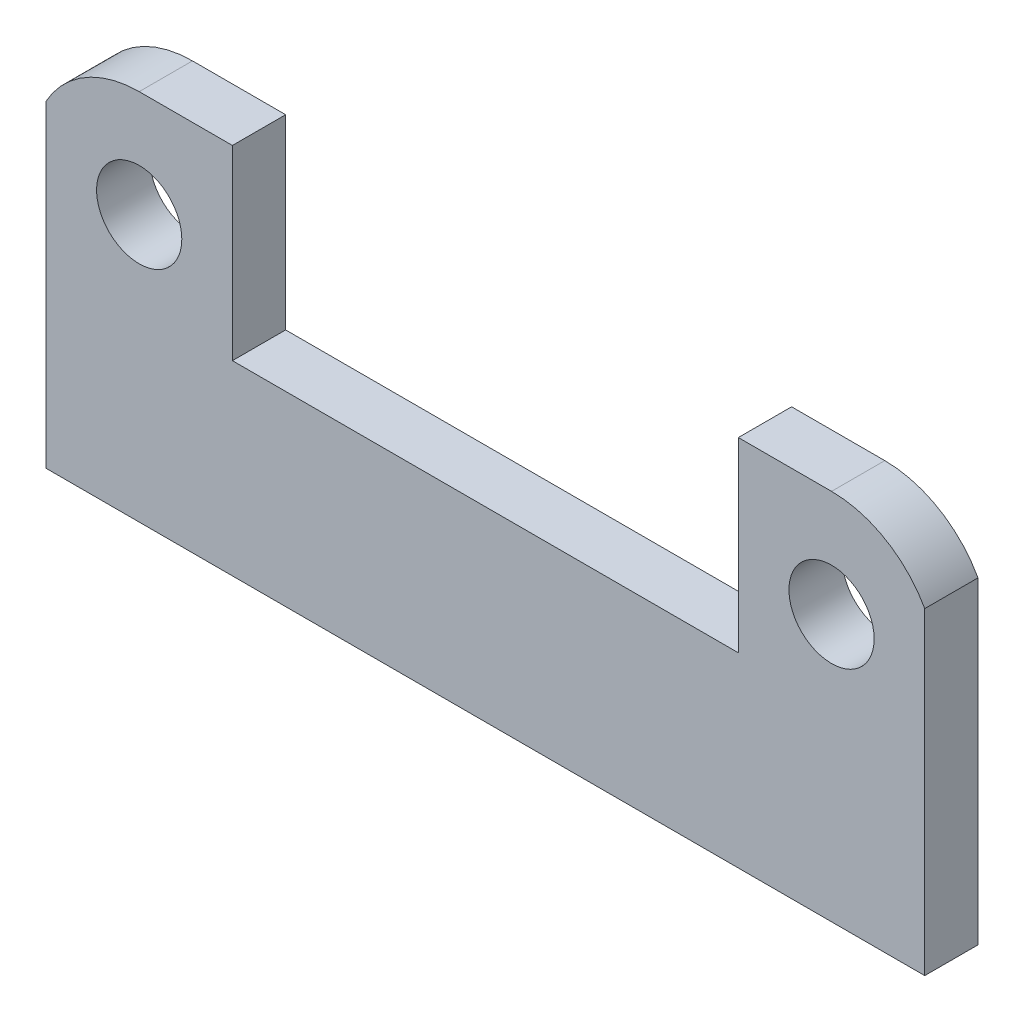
ISO-10303-21;
HEADER;
FILE_DESCRIPTION(('STEP AP214'),'2;1');
FILE_NAME('part.step','',(''),(''),'','','');
FILE_SCHEMA(('AUTOMOTIVE_DESIGN { 1 0 10303 214 1 1 1 1 }'));
ENDSEC;
DATA;
#1=APPLICATION_CONTEXT('core data for automotive mechanical design processes');
#2=APPLICATION_PROTOCOL_DEFINITION('international standard','automotive_design',2000,#1);
#3=PRODUCT_CONTEXT('',#1,'mechanical');
#4=PRODUCT('Part','Part','',(#3));
#5=PRODUCT_RELATED_PRODUCT_CATEGORY('part','',(#4));
#6=PRODUCT_DEFINITION_FORMATION('','',#4);
#7=PRODUCT_DEFINITION_CONTEXT('part definition',#1,'design');
#8=PRODUCT_DEFINITION('design','',#6,#7);
#9=PRODUCT_DEFINITION_SHAPE('','',#8);
#10=(LENGTH_UNIT() NAMED_UNIT(*) SI_UNIT(.MILLI.,.METRE.));
#11=(NAMED_UNIT(*) PLANE_ANGLE_UNIT() SI_UNIT($,.RADIAN.));
#12=(NAMED_UNIT(*) SI_UNIT($,.STERADIAN.) SOLID_ANGLE_UNIT());
#13=UNCERTAINTY_MEASURE_WITH_UNIT(LENGTH_MEASURE(1.E-05),#10,'distance_accuracy_value','');
#14=(GEOMETRIC_REPRESENTATION_CONTEXT(3) GLOBAL_UNCERTAINTY_ASSIGNED_CONTEXT((#13)) GLOBAL_UNIT_ASSIGNED_CONTEXT((#10,
#11,#12)) REPRESENTATION_CONTEXT('',''));
#15=CARTESIAN_POINT('',(0.,0.,0.));
#16=DIRECTION('',(0.,0.,1.));
#17=DIRECTION('',(1.,0.,0.));
#18=AXIS2_PLACEMENT_3D('',#15,#16,#17);
#19=CARTESIAN_POINT('',(2.68385255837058,0.,2.));
#20=DIRECTION('',(-1.,0.,0.));
#21=DIRECTION('',(0.,0.,1.));
#22=AXIS2_PLACEMENT_3D('',#19,#20,#21);
#23=PLANE('',#22);
#24=DIRECTION('',(0.,1.,0.));
#25=VECTOR('',#24,1.);
#26=CARTESIAN_POINT('',(2.68385255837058,0.,0.));
#27=LINE('',#26,#25);
#28=CARTESIAN_POINT('',(2.68385255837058,15.7411385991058,0.));
#29=VERTEX_POINT('',#28);
#30=CARTESIAN_POINT('',(2.68385255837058,22.7411385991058,0.));
#31=VERTEX_POINT('',#30);
#32=EDGE_CURVE('E153',#29,#31,#27,.T.);
#33=ORIENTED_EDGE('',*,*,#32,.T.);
#34=DIRECTION('',(0.,0.,-1.));
#35=VECTOR('',#34,1.);
#36=CARTESIAN_POINT('',(2.68385255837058,22.7411385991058,2.));
#37=LINE('',#36,#35);
#38=CARTESIAN_POINT('',(2.68385255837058,22.7411385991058,2.));
#39=VERTEX_POINT('',#38);
#40=EDGE_CURVE('E11',#39,#31,#37,.T.);
#41=ORIENTED_EDGE('',*,*,#40,.F.);
#42=DIRECTION('',(0.,1.,0.));
#43=VECTOR('',#42,1.);
#44=CARTESIAN_POINT('',(2.68385255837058,0.,2.));
#45=LINE('',#44,#43);
#46=CARTESIAN_POINT('',(2.68385255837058,15.7411385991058,2.));
#47=VERTEX_POINT('',#46);
#48=EDGE_CURVE('E97',#47,#39,#45,.T.);
#49=ORIENTED_EDGE('',*,*,#48,.F.);
#50=DIRECTION('',(0.,0.,-1.));
#51=VECTOR('',#50,1.);
#52=CARTESIAN_POINT('',(2.68385255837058,15.7411385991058,2.));
#53=LINE('',#52,#51);
#54=EDGE_CURVE('E54',#47,#29,#53,.T.);
#55=ORIENTED_EDGE('',*,*,#54,.T.);
#56=EDGE_LOOP('',(#33,#41,#49,#55));
#57=FACE_BOUND('',#56,.T.);
#58=ADVANCED_FACE('F37',(#57),#23,.F.);
#59=CARTESIAN_POINT('',(0.,22.7411385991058,2.));
#60=DIRECTION('',(0.,1.,0.));
#61=DIRECTION('',(-1.,0.,0.));
#62=AXIS2_PLACEMENT_3D('',#59,#60,#61);
#63=PLANE('',#62);
#64=DIRECTION('',(1.,0.,0.));
#65=VECTOR('',#64,1.);
#66=CARTESIAN_POINT('',(0.,22.7411385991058,0.));
#67=LINE('',#66,#65);
#68=CARTESIAN_POINT('',(-0.816147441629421,22.7411385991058,0.));
#69=VERTEX_POINT('',#68);
#70=EDGE_CURVE('E155',#69,#31,#67,.T.);
#71=ORIENTED_EDGE('',*,*,#70,.F.);
#72=DIRECTION('',(0.,0.,-1.));
#73=VECTOR('',#72,1.);
#74=CARTESIAN_POINT('',(-0.816147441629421,22.7411385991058,2.));
#75=LINE('',#74,#73);
#76=CARTESIAN_POINT('',(-0.816147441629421,22.7411385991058,2.));
#77=VERTEX_POINT('',#76);
#78=EDGE_CURVE('E46',#77,#69,#75,.T.);
#79=ORIENTED_EDGE('',*,*,#78,.F.);
#80=DIRECTION('',(1.,0.,0.));
#81=VECTOR('',#80,1.);
#82=CARTESIAN_POINT('',(0.,22.7411385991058,2.));
#83=LINE('',#82,#81);
#84=EDGE_CURVE('E207',#77,#39,#83,.T.);
#85=ORIENTED_EDGE('',*,*,#84,.T.);
#86=ORIENTED_EDGE('',*,*,#40,.T.);
#87=EDGE_LOOP('',(#71,#79,#85,#86));
#88=FACE_BOUND('',#87,.T.);
#89=ADVANCED_FACE('F206',(#88),#63,.T.);
#90=CARTESIAN_POINT('',(-0.816147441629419,18.7411385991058,2.));
#91=DIRECTION('',(0.,0.,-1.));
#92=DIRECTION('',(-1.,0.,0.));
#93=AXIS2_PLACEMENT_3D('',#90,#91,#92);
#94=CYLINDRICAL_SURFACE('',#93,4.);
#95=CARTESIAN_POINT('',(-0.816147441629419,18.7411385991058,0.));
#96=DIRECTION('',(0.,0.,1.));
#97=DIRECTION('',(1.,0.,0.));
#98=AXIS2_PLACEMENT_3D('',#95,#96,#97);
#99=CIRCLE('',#98,4.);
#100=CARTESIAN_POINT('',(-4.31614744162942,20.6776302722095,0.));
#101=VERTEX_POINT('',#100);
#102=EDGE_CURVE('E158',#69,#101,#99,.T.);
#103=ORIENTED_EDGE('',*,*,#102,.T.);
#104=DIRECTION('',(0.,0.,-1.));
#105=VECTOR('',#104,1.);
#106=CARTESIAN_POINT('',(-4.31614744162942,20.6776302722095,2.));
#107=LINE('',#106,#105);
#108=CARTESIAN_POINT('',(-4.31614744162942,20.6776302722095,2.));
#109=VERTEX_POINT('',#108);
#110=EDGE_CURVE('E191',#109,#101,#107,.T.);
#111=ORIENTED_EDGE('',*,*,#110,.F.);
#112=CARTESIAN_POINT('',(-0.816147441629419,18.7411385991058,2.));
#113=DIRECTION('',(0.,0.,1.));
#114=DIRECTION('',(1.,0.,0.));
#115=AXIS2_PLACEMENT_3D('',#112,#113,#114);
#116=CIRCLE('',#115,4.);
#117=EDGE_CURVE('E197',#77,#109,#116,.T.);
#118=ORIENTED_EDGE('',*,*,#117,.F.);
#119=ORIENTED_EDGE('',*,*,#78,.T.);
#120=EDGE_LOOP('',(#103,#111,#118,#119));
#121=FACE_BOUND('',#120,.T.);
#122=ADVANCED_FACE('F195',(#121),#94,.T.);
#123=CARTESIAN_POINT('',(-4.31614744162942,0.,2.));
#124=DIRECTION('',(-1.,0.,0.));
#125=DIRECTION('',(0.,0.,1.));
#126=AXIS2_PLACEMENT_3D('',#123,#124,#125);
#127=PLANE('',#126);
#128=DIRECTION('',(0.,1.,0.));
#129=VECTOR('',#128,1.);
#130=CARTESIAN_POINT('',(-4.31614744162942,0.,0.));
#131=LINE('',#130,#129);
#132=CARTESIAN_POINT('',(-4.31614744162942,8.74113859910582,0.));
#133=VERTEX_POINT('',#132);
#134=EDGE_CURVE('E161',#133,#101,#131,.T.);
#135=ORIENTED_EDGE('',*,*,#134,.F.);
#136=DIRECTION('',(0.,0.,-1.));
#137=VECTOR('',#136,1.);
#138=CARTESIAN_POINT('',(-4.31614744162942,8.74113859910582,2.));
#139=LINE('',#138,#137);
#140=CARTESIAN_POINT('',(-4.31614744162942,8.74113859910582,2.));
#141=VERTEX_POINT('',#140);
#142=EDGE_CURVE('E189',#141,#133,#139,.T.);
#143=ORIENTED_EDGE('',*,*,#142,.F.);
#144=DIRECTION('',(0.,1.,0.));
#145=VECTOR('',#144,1.);
#146=CARTESIAN_POINT('',(-4.31614744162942,0.,2.));
#147=LINE('',#146,#145);
#148=EDGE_CURVE('E351',#141,#109,#147,.T.);
#149=ORIENTED_EDGE('',*,*,#148,.T.);
#150=ORIENTED_EDGE('',*,*,#110,.T.);
#151=EDGE_LOOP('',(#135,#143,#149,#150));
#152=FACE_BOUND('',#151,.T.);
#153=ADVANCED_FACE('F227',(#152),#127,.T.);
#154=CARTESIAN_POINT('',(0.,8.74113859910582,2.));
#155=DIRECTION('',(0.,1.,0.));
#156=DIRECTION('',(0.,0.,1.));
#157=AXIS2_PLACEMENT_3D('',#154,#155,#156);
#158=PLANE('',#157);
#159=DIRECTION('',(1.,0.,0.));
#160=VECTOR('',#159,1.);
#161=CARTESIAN_POINT('',(0.,8.74113859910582,0.));
#162=LINE('',#161,#160);
#163=CARTESIAN_POINT('',(28.6838525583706,8.74113859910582,0.));
#164=VERTEX_POINT('',#163);
#165=EDGE_CURVE('E164',#133,#164,#162,.T.);
#166=ORIENTED_EDGE('',*,*,#165,.T.);
#167=DIRECTION('',(0.,0.,-1.));
#168=VECTOR('',#167,1.);
#169=CARTESIAN_POINT('',(28.6838525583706,8.74113859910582,2.));
#170=LINE('',#169,#168);
#171=CARTESIAN_POINT('',(28.6838525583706,8.74113859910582,2.));
#172=VERTEX_POINT('',#171);
#173=EDGE_CURVE('E187',#172,#164,#170,.T.);
#174=ORIENTED_EDGE('',*,*,#173,.F.);
#175=DIRECTION('',(1.,0.,0.));
#176=VECTOR('',#175,1.);
#177=CARTESIAN_POINT('',(0.,8.74113859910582,2.));
#178=LINE('',#177,#176);
#179=EDGE_CURVE('E354',#141,#172,#178,.T.);
#180=ORIENTED_EDGE('',*,*,#179,.F.);
#181=ORIENTED_EDGE('',*,*,#142,.T.);
#182=EDGE_LOOP('',(#166,#174,#180,#181));
#183=FACE_BOUND('',#182,.T.);
#184=ADVANCED_FACE('F230',(#183),#158,.F.);
#185=CARTESIAN_POINT('',(28.6838525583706,0.,2.));
#186=DIRECTION('',(1.,0.,0.));
#187=DIRECTION('',(0.,0.,-1.));
#188=AXIS2_PLACEMENT_3D('',#185,#186,#187);
#189=PLANE('',#188);
#190=DIRECTION('',(0.,-1.,0.));
#191=VECTOR('',#190,1.);
#192=CARTESIAN_POINT('',(28.6838525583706,0.,0.));
#193=LINE('',#192,#191);
#194=CARTESIAN_POINT('',(28.6838525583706,20.6776302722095,0.));
#195=VERTEX_POINT('',#194);
#196=EDGE_CURVE('E167',#195,#164,#193,.T.);
#197=ORIENTED_EDGE('',*,*,#196,.F.);
#198=DIRECTION('',(0.,0.,-1.));
#199=VECTOR('',#198,1.);
#200=CARTESIAN_POINT('',(28.6838525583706,20.6776302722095,2.));
#201=LINE('',#200,#199);
#202=CARTESIAN_POINT('',(28.6838525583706,20.6776302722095,2.));
#203=VERTEX_POINT('',#202);
#204=EDGE_CURVE('E185',#203,#195,#201,.T.);
#205=ORIENTED_EDGE('',*,*,#204,.F.);
#206=DIRECTION('',(0.,-1.,0.));
#207=VECTOR('',#206,1.);
#208=CARTESIAN_POINT('',(28.6838525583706,0.,2.));
#209=LINE('',#208,#207);
#210=EDGE_CURVE('E356',#203,#172,#209,.T.);
#211=ORIENTED_EDGE('',*,*,#210,.T.);
#212=ORIENTED_EDGE('',*,*,#173,.T.);
#213=EDGE_LOOP('',(#197,#205,#211,#212));
#214=FACE_BOUND('',#213,.T.);
#215=ADVANCED_FACE('F234',(#214),#189,.T.);
#216=CARTESIAN_POINT('',(25.1838525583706,18.7411385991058,2.));
#217=DIRECTION('',(0.,0.,-1.));
#218=DIRECTION('',(-1.,0.,0.));
#219=AXIS2_PLACEMENT_3D('',#216,#217,#218);
#220=CYLINDRICAL_SURFACE('',#219,4.);
#221=CARTESIAN_POINT('',(25.1838525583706,18.7411385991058,0.));
#222=DIRECTION('',(0.,0.,1.));
#223=DIRECTION('',(1.,0.,0.));
#224=AXIS2_PLACEMENT_3D('',#221,#222,#223);
#225=CIRCLE('',#224,4.);
#226=CARTESIAN_POINT('',(25.1838525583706,22.7411385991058,0.));
#227=VERTEX_POINT('',#226);
#228=EDGE_CURVE('E170',#195,#227,#225,.T.);
#229=ORIENTED_EDGE('',*,*,#228,.T.);
#230=DIRECTION('',(0.,0.,-1.));
#231=VECTOR('',#230,1.);
#232=CARTESIAN_POINT('',(25.1838525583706,22.7411385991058,2.));
#233=LINE('',#232,#231);
#234=CARTESIAN_POINT('',(25.1838525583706,22.7411385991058,2.));
#235=VERTEX_POINT('',#234);
#236=EDGE_CURVE('E139',#235,#227,#233,.T.);
#237=ORIENTED_EDGE('',*,*,#236,.F.);
#238=CARTESIAN_POINT('',(25.1838525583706,18.7411385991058,2.));
#239=DIRECTION('',(0.,0.,1.));
#240=DIRECTION('',(1.,0.,0.));
#241=AXIS2_PLACEMENT_3D('',#238,#239,#240);
#242=CIRCLE('',#241,4.);
#243=EDGE_CURVE('E127',#203,#235,#242,.T.);
#244=ORIENTED_EDGE('',*,*,#243,.F.);
#245=ORIENTED_EDGE('',*,*,#204,.T.);
#246=EDGE_LOOP('',(#229,#237,#244,#245));
#247=FACE_BOUND('',#246,.T.);
#248=ADVANCED_FACE('F238',(#247),#220,.T.);
#249=CARTESIAN_POINT('',(0.,22.7411385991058,2.));
#250=DIRECTION('',(0.,-1.,0.));
#251=DIRECTION('',(1.,0.,0.));
#252=AXIS2_PLACEMENT_3D('',#249,#250,#251);
#253=PLANE('',#252);
#254=DIRECTION('',(-1.,0.,0.));
#255=VECTOR('',#254,1.);
#256=CARTESIAN_POINT('',(0.,22.7411385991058,0.));
#257=LINE('',#256,#255);
#258=CARTESIAN_POINT('',(21.6838525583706,22.7411385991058,0.));
#259=VERTEX_POINT('',#258);
#260=EDGE_CURVE('E136',#227,#259,#257,.T.);
#261=ORIENTED_EDGE('',*,*,#260,.T.);
#262=DIRECTION('',(0.,0.,-1.));
#263=VECTOR('',#262,1.);
#264=CARTESIAN_POINT('',(21.6838525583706,22.7411385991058,2.));
#265=LINE('',#264,#263);
#266=CARTESIAN_POINT('',(21.6838525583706,22.7411385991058,2.));
#267=VERTEX_POINT('',#266);
#268=EDGE_CURVE('E133',#267,#259,#265,.T.);
#269=ORIENTED_EDGE('',*,*,#268,.F.);
#270=DIRECTION('',(-1.,0.,0.));
#271=VECTOR('',#270,1.);
#272=CARTESIAN_POINT('',(0.,22.7411385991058,2.));
#273=LINE('',#272,#271);
#274=EDGE_CURVE('E119',#235,#267,#273,.T.);
#275=ORIENTED_EDGE('',*,*,#274,.F.);
#276=ORIENTED_EDGE('',*,*,#236,.T.);
#277=EDGE_LOOP('',(#261,#269,#275,#276));
#278=FACE_BOUND('',#277,.T.);
#279=ADVANCED_FACE('F134',(#278),#253,.F.);
#280=CARTESIAN_POINT('',(21.6838525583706,0.,2.));
#281=DIRECTION('',(-1.,0.,0.));
#282=DIRECTION('',(0.,0.,1.));
#283=AXIS2_PLACEMENT_3D('',#280,#281,#282);
#284=PLANE('',#283);
#285=DIRECTION('',(0.,1.,0.));
#286=VECTOR('',#285,1.);
#287=CARTESIAN_POINT('',(21.6838525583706,0.,0.));
#288=LINE('',#287,#286);
#289=CARTESIAN_POINT('',(21.6838525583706,15.7411385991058,0.));
#290=VERTEX_POINT('',#289);
#291=EDGE_CURVE('E173',#290,#259,#288,.T.);
#292=ORIENTED_EDGE('',*,*,#291,.F.);
#293=DIRECTION('',(0.,0.,-1.));
#294=VECTOR('',#293,1.);
#295=CARTESIAN_POINT('',(21.6838525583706,15.7411385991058,2.));
#296=LINE('',#295,#294);
#297=CARTESIAN_POINT('',(21.6838525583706,15.7411385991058,2.));
#298=VERTEX_POINT('',#297);
#299=EDGE_CURVE('E85',#298,#290,#296,.T.);
#300=ORIENTED_EDGE('',*,*,#299,.F.);
#301=DIRECTION('',(0.,1.,0.));
#302=VECTOR('',#301,1.);
#303=CARTESIAN_POINT('',(21.6838525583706,0.,2.));
#304=LINE('',#303,#302);
#305=EDGE_CURVE('E124',#298,#267,#304,.T.);
#306=ORIENTED_EDGE('',*,*,#305,.T.);
#307=ORIENTED_EDGE('',*,*,#268,.T.);
#308=EDGE_LOOP('',(#292,#300,#306,#307));
#309=FACE_BOUND('',#308,.T.);
#310=ADVANCED_FACE('F141',(#309),#284,.T.);
#311=CARTESIAN_POINT('',(0.,15.7411385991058,2.));
#312=DIRECTION('',(0.,1.,0.));
#313=DIRECTION('',(0.,0.,1.));
#314=AXIS2_PLACEMENT_3D('',#311,#312,#313);
#315=PLANE('',#314);
#316=DIRECTION('',(1.,0.,0.));
#317=VECTOR('',#316,1.);
#318=CARTESIAN_POINT('',(0.,15.7411385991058,0.));
#319=LINE('',#318,#317);
#320=EDGE_CURVE('E175',#29,#290,#319,.T.);
#321=ORIENTED_EDGE('',*,*,#320,.F.);
#322=ORIENTED_EDGE('',*,*,#54,.F.);
#323=DIRECTION('',(1.,0.,0.));
#324=VECTOR('',#323,1.);
#325=CARTESIAN_POINT('',(0.,15.7411385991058,2.));
#326=LINE('',#325,#324);
#327=EDGE_CURVE('E142',#47,#298,#326,.T.);
#328=ORIENTED_EDGE('',*,*,#327,.T.);
#329=ORIENTED_EDGE('',*,*,#299,.T.);
#330=EDGE_LOOP('',(#321,#322,#328,#329));
#331=FACE_BOUND('',#330,.T.);
#332=ADVANCED_FACE('F208',(#331),#315,.T.);
#333=CARTESIAN_POINT('',(-0.816147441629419,18.7411385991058,2.));
#334=DIRECTION('',(0.,0.,-1.));
#335=DIRECTION('',(-1.,0.,0.));
#336=AXIS2_PLACEMENT_3D('',#333,#334,#335);
#337=CYLINDRICAL_SURFACE('',#336,1.6);
#338=CARTESIAN_POINT('',(-0.816147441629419,18.7411385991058,2.));
#339=DIRECTION('',(0.,0.,1.));
#340=DIRECTION('',(1.,0.,0.));
#341=AXIS2_PLACEMENT_3D('',#338,#339,#340);
#342=CIRCLE('',#341,1.6);
#343=CARTESIAN_POINT('',(0.783852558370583,18.7411385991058,2.));
#344=VERTEX_POINT('',#343);
#345=EDGE_CURVE('E181',#344,#344,#342,.T.);
#346=ORIENTED_EDGE('',*,*,#345,.T.);
#347=EDGE_LOOP('',(#346));
#348=FACE_BOUND('',#347,.T.);
#349=CARTESIAN_POINT('',(-0.816147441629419,18.7411385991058,0.));
#350=DIRECTION('',(0.,0.,1.));
#351=DIRECTION('',(1.,0.,0.));
#352=AXIS2_PLACEMENT_3D('',#349,#350,#351);
#353=CIRCLE('',#352,1.6);
#354=CARTESIAN_POINT('',(0.783852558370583,18.7411385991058,0.));
#355=VERTEX_POINT('',#354);
#356=EDGE_CURVE('E150',#355,#355,#353,.T.);
#357=ORIENTED_EDGE('',*,*,#356,.F.);
#358=EDGE_LOOP('',(#357));
#359=FACE_BOUND('',#358,.T.);
#360=ADVANCED_FACE('F39',(#348,#359),#337,.F.);
#361=CARTESIAN_POINT('',(25.1838525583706,18.7411385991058,2.));
#362=DIRECTION('',(0.,0.,-1.));
#363=DIRECTION('',(-1.,0.,0.));
#364=AXIS2_PLACEMENT_3D('',#361,#362,#363);
#365=CYLINDRICAL_SURFACE('',#364,1.6);
#366=CARTESIAN_POINT('',(25.1838525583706,18.7411385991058,2.));
#367=DIRECTION('',(0.,0.,1.));
#368=DIRECTION('',(1.,0.,0.));
#369=AXIS2_PLACEMENT_3D('',#366,#367,#368);
#370=CIRCLE('',#369,1.6);
#371=CARTESIAN_POINT('',(26.7838525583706,18.7411385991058,2.));
#372=VERTEX_POINT('',#371);
#373=EDGE_CURVE('E144',#372,#372,#370,.T.);
#374=ORIENTED_EDGE('',*,*,#373,.T.);
#375=EDGE_LOOP('',(#374));
#376=FACE_BOUND('',#375,.T.);
#377=CARTESIAN_POINT('',(25.1838525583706,18.7411385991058,0.));
#378=DIRECTION('',(0.,0.,1.));
#379=DIRECTION('',(1.,0.,0.));
#380=AXIS2_PLACEMENT_3D('',#377,#378,#379);
#381=CIRCLE('',#380,1.6);
#382=CARTESIAN_POINT('',(26.7838525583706,18.7411385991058,0.));
#383=VERTEX_POINT('',#382);
#384=EDGE_CURVE('E178',#383,#383,#381,.T.);
#385=ORIENTED_EDGE('',*,*,#384,.F.);
#386=EDGE_LOOP('',(#385));
#387=FACE_BOUND('',#386,.T.);
#388=ADVANCED_FACE('F215',(#376,#387),#365,.F.);
#389=CARTESIAN_POINT('',(0.,0.,2.));
#390=DIRECTION('',(0.,0.,1.));
#391=DIRECTION('',(1.,0.,0.));
#392=AXIS2_PLACEMENT_3D('',#389,#390,#391);
#393=PLANE('',#392);
#394=ORIENTED_EDGE('',*,*,#345,.F.);
#395=EDGE_LOOP('',(#394));
#396=FACE_BOUND('',#395,.T.);
#397=ORIENTED_EDGE('',*,*,#48,.T.);
#398=ORIENTED_EDGE('',*,*,#84,.F.);
#399=ORIENTED_EDGE('',*,*,#117,.T.);
#400=ORIENTED_EDGE('',*,*,#148,.F.);
#401=ORIENTED_EDGE('',*,*,#179,.T.);
#402=ORIENTED_EDGE('',*,*,#210,.F.);
#403=ORIENTED_EDGE('',*,*,#243,.T.);
#404=ORIENTED_EDGE('',*,*,#274,.T.);
#405=ORIENTED_EDGE('',*,*,#305,.F.);
#406=ORIENTED_EDGE('',*,*,#327,.F.);
#407=EDGE_LOOP('',(#397,#398,#399,#400,#401,#402,#403,#404,#405,#406));
#408=FACE_BOUND('',#407,.T.);
#409=ORIENTED_EDGE('',*,*,#373,.F.);
#410=EDGE_LOOP('',(#409));
#411=FACE_BOUND('',#410,.T.);
#412=ADVANCED_FACE('F121',(#396,#408,#411),#393,.T.);
#413=CARTESIAN_POINT('',(0.,0.,0.));
#414=DIRECTION('',(0.,0.,1.));
#415=DIRECTION('',(1.,0.,0.));
#416=AXIS2_PLACEMENT_3D('',#413,#414,#415);
#417=PLANE('',#416);
#418=ORIENTED_EDGE('',*,*,#356,.T.);
#419=EDGE_LOOP('',(#418));
#420=FACE_BOUND('',#419,.T.);
#421=ORIENTED_EDGE('',*,*,#32,.F.);
#422=ORIENTED_EDGE('',*,*,#320,.T.);
#423=ORIENTED_EDGE('',*,*,#291,.T.);
#424=ORIENTED_EDGE('',*,*,#260,.F.);
#425=ORIENTED_EDGE('',*,*,#228,.F.);
#426=ORIENTED_EDGE('',*,*,#196,.T.);
#427=ORIENTED_EDGE('',*,*,#165,.F.);
#428=ORIENTED_EDGE('',*,*,#134,.T.);
#429=ORIENTED_EDGE('',*,*,#102,.F.);
#430=ORIENTED_EDGE('',*,*,#70,.T.);
#431=EDGE_LOOP('',(#421,#422,#423,#424,#425,#426,#427,#428,#429,#430));
#432=FACE_BOUND('',#431,.T.);
#433=ORIENTED_EDGE('',*,*,#384,.T.);
#434=EDGE_LOOP('',(#433));
#435=FACE_BOUND('',#434,.T.);
#436=ADVANCED_FACE('F202',(#420,#432,#435),#417,.F.);
#437=CLOSED_SHELL('',(#58,#89,#122,#153,#184,#215,#248,#279,#310,#332,#360,#388,#412,#436));
#438=MANIFOLD_SOLID_BREP('B2',#437);
#439=ADVANCED_BREP_SHAPE_REPRESENTATION('',(#18,#438),#14);
#440=SHAPE_DEFINITION_REPRESENTATION(#9,#439);
ENDSEC;
END-ISO-10303-21;
